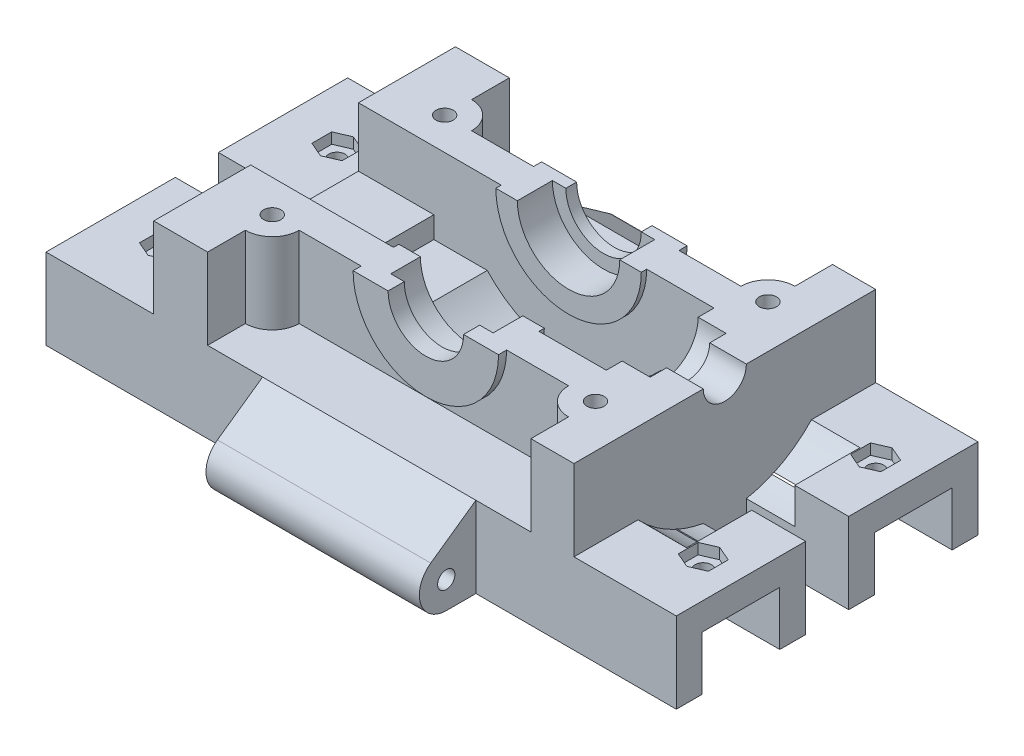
from build123d import *
from build123d.topology import SkipClean

# Parameters (mm, degrees)
SKETCH_1_W                = 10
SKETCH_1_H                = 35
EXTRUDE_3_DEPTH           = 6
SKETCH_1_5_W              = 19.8
SKETCH_1_5_H              = 10
EXTRUDE_4_DEPTH           = 16.5
SKETCH_2_R                = 1.6
CUT_EXTRUDE_1_DEPTH       = 39.6
SKETCH_1_6_W              = 19.8
SKETCH_1_6_H              = 10
SKETCH_1_6_W_2            = 10
SKETCH_1_6_H_2            = 35
EXTRUDE_5_DEPTH           = 40
SKETCH_3_W                = 39.6
SKETCH_3_H                = 10
EXTRUDE_6_DEPTH           = 10.5
SKETCH_4_R                = 1.6
CUT_EXTRUDE_2_DEPTH       = 39.6
EXTRUDE_7_DEPTH           = 12
EXTRUDE_8_REACH           = 114.364
SKETCH_6_W                = 7.093277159
SKETCH_6_H                = 12
SKETCH_6_W_2              = 11.017279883
EXTRUDE_9_DEPTH           = 20
EXTRUDE_9_DEPTH_BACK      = 5
SKETCH_10_W               = 8
SKETCH_10_H               = 7.758717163
CUT_EXTRUDE_10_DEPTH      = 10
SKETCH_9_R                = 1.5
CUT_EXTRUDE_11_DEPTH      = 130.929296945
SKETCH_19_W               = 60
SKETCH_19_H               = 56
EXTRUDE_13_DEPTH          = 5
SKETCH_18_W               = 14.4
SKETCH_18_H               = 10
CUT_EXTRUDE_9_DEPTH       = 142.736982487
EXTRUDE_14_DEPTH          = 20
EXTRUDE_14_DEPTH_BACK     = 100
SKETCH_18_5_W             = 4.8
SKETCH_18_5_H             = 10
SKETCH_11_W               = 2.5
SKETCH_11_H               = 56.730774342
EXTRUDE_15_DEPTH          = 10
SKETCH_20_R               = 1.5
CUT_EXTRUDE_12_DEPTH      = 5
SKETCH_20_3_R             = 1.5
CUT_EXTRUDE_13_DEPTH      = 2
SKETCH_22_W               = 14
SKETCH_22_H               = 15
SKETCH_22_H_2             = 20
CUT_EXTRUDE_14_DEPTH      = 10
CUT_EXTRUDE_15_DEPTH      = 10
CUT_EXTRUDE_15_DEPTH_BACK = 10
SKETCH_24_W               = 10
SKETCH_24_H               = 30
EXTRUDE_16_DEPTH          = 4
SKETCH_25_W               = 10
SKETCH_25_H               = 30
EXTRUDE_17_DEPTH          = 4
SKETCH_28_R               = 4
CUT_EXTRUDE_18_DEPTH      = 14
CUT_EXTRUDE_START         = -5.2
SKETCH_29_R               = 7.05
SKETCH_29_R_2             = 4
CUT_EXTRUDE_19_DEPTH      = 5.2
CUT_EXTRUDE_20_DEPTH      = 7
SKETCH_28_5_R             = 5.5
SKETCH_28_5_R_2           = 4
CUT_EXTRUDE_21_DEPTH      = 2
CUT_EXTRUDE_23_DEPTH      = 3
CUT_EXTRUDE_24_REACH      = 153.981
SKETCH_33_W               = 10
SKETCH_33_H               = 26
CUT_EXTRUDE_START_2       = -2
SKETCH_34_R               = 5.5
CUT_EXTRUDE_25_DEPTH      = 2
EXTRUDE_18_DEPTH          = 39.6
EXTRUDE_19_DEPTH          = 9
EXTRUDE_20_REACH          = 149.612
SKETCH_37_W               = 6
SKETCH_37_H               = 30
SKETCH_38_R               = 7
CUT_EXTRUDE_26_DEPTH      = 158.359422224
EXTRUDE_START             = 1.5
SKETCH_38_3_R             = 13.5
SKETCH_38_3_R_2           = 9.5
SKETCH_38_3_R_3           = 7
EXTRUDE_21_DEPTH          = 1.5
SKETCH_39_R               = 13.5
SKETCH_39_R_2             = 7
EXTRUDE_22_DEPTH          = 1.5
SKETCH_41_R               = 13.5
SKETCH_41_R_2             = 9.5
SKETCH_41_R_3             = 7
EXTRUDE_23_DEPTH          = 1
CUT_EXTRUDE_27_DEPTH      = 5.5
CUT_EXTRUDE_27_DEPTH_BACK = 4.5
SKETCH_41_3_R             = 9.5
SKETCH_41_3_R_2           = 7
EXTRUDE_START_2           = 1
SKETCH_42_R               = 13.5
SKETCH_42_R_2             = 9.5
SKETCH_42_R_3             = 7
EXTRUDE_24_DEPTH          = 1
CUT_EXTRUDE_28_DEPTH      = 1
CUT_EXTRUDE_28_DEPTH_BACK = 5.5
SKETCH_42_3_R             = 9.5
SKETCH_42_3_R_2           = 7
CUT_EXTRUDE_30_DEPTH      = 20
CUT_EXTRUDE_30_DEPTH_BACK = 136.224032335
SKETCH_43_R               = 1.6
EXTRUDE_25_DEPTH          = 15
SKETCH_45_R               = 1.6
CUT_EXTRUDE_31_DEPTH      = 3
SKETCH_46_R               = 1.6
CUT_EXTRUDE_32_DEPTH      = 3
EXTRUDE_START_3           = 30
EXTRUDE_26_DEPTH          = 30
SKETCH_48_W               = 198.317172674
SKETCH_48_H               = 160.47694892
CUT_EXTRUDE_33_DEPTH      = 148.85053757


with BuildPart() as part:
    # Sketch 1 → Extrude 3 (new body)
    with BuildSketch(Plane.XY):
        with Locations((-7.633778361, 10.555029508)):
            Rectangle(SKETCH_1_W, SKETCH_1_H)
        Polygon((-22.833778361, 38.055029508), (-22.833778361, 28.055029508), (-12.633778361, 28.055029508), (-2.633778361, 28.055029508), (-2.633778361, 38.055029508), align=None)
        Polygon((-12.633778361, -6.944970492), (-22.833778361, -6.944970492), (-22.833778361, -16.944970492), (-2.633778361, -16.944970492), (-2.633778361, -6.944970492), align=None)
        Polygon((-62.433778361, -6.944970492), (-72.633778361, -6.944970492), (-82.633778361, -6.944970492), (-82.633778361, -16.944970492), (-62.433778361, -16.944970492), align=None)
        with Locations((-77.633778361, 10.555029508)):
            Rectangle(SKETCH_1_W, SKETCH_1_H)
        Polygon((-82.633778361, 28.055029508), (-72.633778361, 28.055029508), (-62.433778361, 28.055029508), (-62.433778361, 38.055029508), (-82.633778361, 38.055029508), align=None)
    extrude(amount=EXTRUDE_3_DEPTH)

    # Sketch 1_5 → Extrude 4 (add)
    with BuildSketch(Plane.XY):
        with Locations((-52.533778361, 33.055029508)):
            Rectangle(SKETCH_1_5_W, SKETCH_1_5_H)
        with Locations((-32.733778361, 33.055029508)):
            Rectangle(SKETCH_1_5_W, SKETCH_1_5_H)
        with Locations((-52.533778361, -11.944970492)):
            Rectangle(SKETCH_1_5_W, SKETCH_1_5_H)
        with Locations((-32.733778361, -11.944970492)):
            Rectangle(SKETCH_1_5_W, SKETCH_1_5_H)
    extrude(amount=EXTRUDE_4_DEPTH)

    # Sketch 2 → Cut-Extrude 1 (cut)
    with BuildSketch(Plane(origin=(-22.833778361, 0, 0), x_dir=(0, 0, -1), z_dir=(1, 0, 0))):
        with Locations((-11.5, 33.055029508)):
            Circle(SKETCH_2_R)
        with BuildLine():
            Line((-16.5, 38.055029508), (-16.5, 33.055029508))
            ThreePointArc((-16.5, 33.055029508), (-15.035533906, 36.590563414), (-11.5, 38.055029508))
            Line((-11.5, 38.055029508), (-16.5, 38.055029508))
        make_face()
        with BuildLine():
            Line((-16.5, 33.055029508), (-16.5, 28.055029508))
            Line((-16.5, 28.055029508), (-11.5, 28.055029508))
            ThreePointArc((-11.5, 28.055029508), (-15.035533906, 29.519495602), (-16.5, 33.055029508))
        make_face()
        with Locations((-11.5, -11.944970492)):
            Circle(SKETCH_2_R)
        with BuildLine():
            Line((-16.5, -6.944970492), (-16.5, -11.944970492))
            ThreePointArc((-16.5, -11.944970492), (-15.035533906, -8.409436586), (-11.5, -6.944970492))
            Line((-11.5, -6.944970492), (-16.5, -6.944970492))
        make_face()
        with BuildLine():
            Line((-16.5, -11.944970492), (-16.5, -16.944970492))
            Line((-16.5, -16.944970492), (-11.5, -16.944970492))
            ThreePointArc((-11.5, -16.944970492), (-15.035533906, -15.480504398), (-16.5, -11.944970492))
        make_face()
    extrude(amount=-CUT_EXTRUDE_1_DEPTH, mode=Mode.SUBTRACT)

    # Sketch 1_6 → Extrude 5 (add)
    with BuildSketch(Plane.XY):
        Polygon((-22.833778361, 38.055029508), (-22.833778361, 28.055029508), (-12.633778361, 28.055029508), (-2.633778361, 28.055029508), (-2.633778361, 38.055029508), align=None)
        with Locations((-32.733778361, 33.055029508)):
            Rectangle(SKETCH_1_6_W, SKETCH_1_6_H)
        with Locations((-52.533778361, 33.055029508)):
            Rectangle(SKETCH_1_6_W, SKETCH_1_6_H)
        Polygon((-82.633778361, 28.055029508), (-72.633778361, 28.055029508), (-62.433778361, 28.055029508), (-62.433778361, 38.055029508), (-82.633778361, 38.055029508), align=None)
        with Locations((-77.633778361, 10.555029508)):
            Rectangle(SKETCH_1_6_W_2, SKETCH_1_6_H_2)
        Polygon((-62.433778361, -6.944970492), (-72.633778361, -6.944970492), (-82.633778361, -6.944970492), (-82.633778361, -16.944970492), (-62.433778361, -16.944970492), align=None)
        with Locations((-52.533778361, -11.944970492)):
            Rectangle(SKETCH_1_6_W, SKETCH_1_6_H)
        Polygon((-12.633778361, -6.944970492), (-22.833778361, -6.944970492), (-22.833778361, -16.944970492), (-2.633778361, -16.944970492), (-2.633778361, -6.944970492), align=None)
        with Locations((-7.633778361, 10.555029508)):
            Rectangle(SKETCH_1_6_W_2, SKETCH_1_6_H_2)
        with Locations((-32.733778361, -11.944970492)):
            Rectangle(SKETCH_1_6_W, SKETCH_1_6_H)
    extrude(amount=-EXTRUDE_5_DEPTH)

    # Sketch 3 → Extrude 6 (add)
    with BuildSketch(Plane(origin=(0, 0, -40), x_dir=(-1, 0, 0), z_dir=(0, 0, -1))):
        with Locations((42.633778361, 33.055029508)):
            Rectangle(SKETCH_3_W, SKETCH_3_H)
        with Locations((42.633778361, -11.944970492)):
            Rectangle(SKETCH_3_W, SKETCH_3_H)
    extrude(amount=EXTRUDE_6_DEPTH)

    # Sketch 4 → Cut-Extrude 2 (cut)
    with BuildSketch(Plane(origin=(-22.833778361, 0, 0), x_dir=(0, 0, -1), z_dir=(1, 0, 0))):
        with BuildLine():
            Line((50.5, 38.055029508), (45.5, 38.055029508))
            ThreePointArc((45.5, 38.055029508), (49.035533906, 36.590563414), (50.5, 33.055029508))
            Line((50.5, 33.055029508), (50.5, 38.055029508))
        make_face()
        with Locations((45.5, 33.055029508)):
            Circle(SKETCH_4_R)
        with BuildLine():
            ThreePointArc((50.5, 33.055029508), (49.035533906, 29.519495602), (45.5, 28.055029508))
            Line((45.5, 28.055029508), (50.5, 28.055029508))
            Line((50.5, 28.055029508), (50.5, 33.055029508))
        make_face()
        with BuildLine():
            ThreePointArc((50.5, -11.944970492), (49.035533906, -15.480504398), (45.5, -16.944970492))
            Line((45.5, -16.944970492), (50.5, -16.944970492))
            Line((50.5, -16.944970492), (50.5, -11.944970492))
        make_face()
        with BuildLine():
            Line((50.5, -6.944970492), (45.5, -6.944970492))
            ThreePointArc((45.5, -6.944970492), (49.035533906, -8.409436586), (50.5, -11.944970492))
            Line((50.5, -11.944970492), (50.5, -6.944970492))
        make_face()
        with Locations((45.5, -11.944970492)):
            Circle(SKETCH_4_R)
    extrude(amount=-CUT_EXTRUDE_2_DEPTH, mode=Mode.SUBTRACT)

    # Extrude 8: up to this face of the body (flat: up to its plane)
    extrude_8_end = Plane(part.part.faces().sort_by_distance((-42.633778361, 38.055029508, -17))[0])
    # Sketch 6 → Extrude 8 (add, up to the picked face)
    with BuildSketch(Plane(origin=(0, 45.962215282, -13.952833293), x_dir=(1, 0, 0), z_dir=(0, -0.9568804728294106, 0.290481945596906)), mode=Mode.PRIVATE) as extrude_8_sk1:
        with Locations((-79.087139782, -21.220919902)):
            Rectangle(SKETCH_6_W, SKETCH_6_H)
    extrude_8_tool1 = split(extrude(extrude_8_sk1.sketch, amount=EXTRUDE_8_REACH, mode=Mode.PRIVATE), bisect_by=extrude_8_end, keep=Keep.BOTH, mode=Mode.PRIVATE)
    # Sketch 6 → Extrude 8 (add, up to the picked face)
    with BuildSketch(Plane(origin=(0, 45.962215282, -13.952833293), x_dir=(1, 0, 0), z_dir=(0, -0.9568804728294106, 0.290481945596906)), mode=Mode.PRIVATE) as extrude_8_sk2:
        with Locations((-8.142418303, -21.220919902)):
            Rectangle(SKETCH_6_W_2, SKETCH_6_H)
    extrude_8_tool2 = split(extrude(extrude_8_sk2.sketch, amount=EXTRUDE_8_REACH, mode=Mode.PRIVATE), bisect_by=extrude_8_end, keep=Keep.BOTH, mode=Mode.PRIVATE)


with BuildPart() as body_2:
    # Sketch 5 → Extrude 7 (new body)
    with BuildSketch(Plane(origin=(0, -7.907185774, -26.047166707), x_dir=(1, 0, 0), z_dir=(0, 0.290481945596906, 0.9568804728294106))):
        Polygon((-73.133778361, 106.033392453), (-82.633778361, 48.033392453), (-77.567151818, 48.033392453), (-69.133778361, 99.521356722), (-69.133778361, 106.033392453), align=None)
        Polygon((-69.133778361, 106.033392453), (-69.133778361, 99.521356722), (-67.374533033, 97.888777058), (-13.651058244, 48.033392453), (-2.633778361, 48.033392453), (-65.133778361, 106.033392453), align=None)
        Polygon((-69.133778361, 99.521356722), (-77.567151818, 48.033392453), (-75.540501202, 48.033392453), (-69.133778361, 87.148121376), align=None)
        Polygon((-67.374533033, 97.888777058), (-69.133778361, 99.521356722), (-69.133778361, 87.148121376), align=None)
    extrude(amount=EXTRUDE_7_DEPTH)


with BuildPart() as part_1:
    add(part.part)

    add(body_2.part)  # Extrude 8 merges body 2
    add(extrude_8_tool1.solids().sort_by(Axis((-79.08714, 39.797921, -34.258717), (0, -0.9568804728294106, 0.290481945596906)))[0])
    add(extrude_8_tool2.solids().sort_by(Axis((-8.142418, 39.797921, -34.258717), (0, -0.9568804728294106, 0.290481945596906)))[0])

    # Sketch 7 → Extrude 9 (add, two sides: drawn at the far end of the back side and taken through both)
    with BuildSketch(Plane(origin=(0, 0, -45.365387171), x_dir=(-1, 0, 0), z_dir=(0, 0, -1)).offset(-EXTRUDE_9_DEPTH_BACK)):
        Polygon((73.133778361, 97.039880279), (65.133778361, 97.039880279), (59.133778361, 97.039880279), (59.133778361, 87.039880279), (79.133778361, 87.039880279), (79.133778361, 97.039880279), align=None)
    extrude(amount=EXTRUDE_9_DEPTH + EXTRUDE_9_DEPTH_BACK)

    # Sketch 10 → Cut-Extrude 10 (cut)
    with BuildSketch(Plane(origin=(0, 97.039880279, 0), x_dir=(1, 0, 0), z_dir=(0, 1, 0))):
        with Locations((-69.133778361, 61.48602859)):
            Rectangle(SKETCH_10_W, SKETCH_10_H)
    extrude(amount=-CUT_EXTRUDE_10_DEPTH, mode=Mode.SUBTRACT)

    # Sketch 9 → Cut-Extrude 11 (cut, through all)
    with BuildSketch(Plane(origin=(-59.133778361, 0, 0), x_dir=(0, 0, -1), z_dir=(1, 0, 0))):
        with BuildLine():
            Line((65.365387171, 97.039880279), (60.365387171, 97.039880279))
            ThreePointArc((60.365387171, 97.039880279), (63.900921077, 95.575414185), (65.365387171, 92.039880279))
            Line((65.365387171, 92.039880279), (65.365387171, 97.039880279))
        make_face()
        with BuildLine():
            Line((65.365387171, 87.039880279), (65.365387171, 92.039880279))
            ThreePointArc((65.365387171, 92.039880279), (63.900921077, 88.504346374), (60.365387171, 87.039880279))
            Line((60.365387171, 87.039880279), (65.365387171, 87.039880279))
        make_face()
        with Locations((60.365387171, 92.039880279)):
            Circle(SKETCH_9_R)
    extrude(amount=-CUT_EXTRUDE_11_DEPTH, mode=Mode.SUBTRACT)

    # Mirror 24: part across plane


with BuildPart() as part_2:
    add(part_1.part)
    add(part_1.part.mirror(Plane.XY.offset(-12)))

    # Sketch 19 → Extrude 13 (add)
    with BuildSketch(Plane(origin=(0, -6.944970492, 0), x_dir=(1, 0, 0), z_dir=(0, 1, 0))):
        with Locations((-42.633778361, 12)):
            Rectangle(SKETCH_19_W, SKETCH_19_H)
    extrude(amount=EXTRUDE_13_DEPTH)

    # Sketch 18 → Cut-Extrude 9 (cut, through all)
    with BuildSketch(Plane(origin=(-2.633778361, 0, 0), x_dir=(0, 0, -1), z_dir=(1, 0, 0))):
        with Locations((-4, -11.944970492)):
            Rectangle(SKETCH_18_W, SKETCH_18_H)
        with Locations((28, -11.944970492)):
            Rectangle(SKETCH_18_W, SKETCH_18_H)
    extrude(amount=-CUT_EXTRUDE_9_DEPTH, mode=Mode.SUBTRACT)

    # Sketch 18_5 → Extrude 14 (add, two sides: drawn at the far end of the back side and taken through both)
    with BuildSketch(Plane(origin=(-2.633778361, 0, 0), x_dir=(0, 0, -1), z_dir=(1, 0, 0)).offset(-EXTRUDE_14_DEPTH_BACK)):
        Polygon((-16, -1.944970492), (-16, -6.944970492), (-11.2, -6.944970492), (3.2, -6.944970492), (8, -6.944970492), (8, -1.944970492), align=None)
        with Locations((-13.6, -11.944970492)):
            Rectangle(SKETCH_18_5_W, SKETCH_18_5_H)
        with Locations((5.6, -11.944970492)):
            Rectangle(SKETCH_18_5_W, SKETCH_18_5_H)
        Polygon((40, -1.944970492), (16, -1.944970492), (16, -6.944970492), (20.8, -6.944970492), (35.2, -6.944970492), (40, -6.944970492), align=None)
        with Locations((18.4, -11.944970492)):
            Rectangle(SKETCH_18_5_W, SKETCH_18_5_H)
        with Locations((37.6, -11.944970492)):
            Rectangle(SKETCH_18_5_W, SKETCH_18_5_H)
    extrude(amount=EXTRUDE_14_DEPTH + EXTRUDE_14_DEPTH_BACK)

    # Sketch 11 → Extrude 15 (add)
    with BuildSketch(Plane(origin=(0, 97.039880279, 0), x_dir=(1, 0, 0), z_dir=(0, 1, 0))):
        with Locations((-67.883778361, 12)):
            Rectangle(SKETCH_11_W, SKETCH_11_H)
        with Locations((-70.383778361, 12)):
            Rectangle(SKETCH_11_W, SKETCH_11_H)
    extrude(amount=-EXTRUDE_15_DEPTH)

    # Sketch 20 → Cut-Extrude 12 (cut)
    with BuildSketch(Plane(origin=(0, -1.944970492, 0), x_dir=(1, 0, 0), z_dir=(0, 1, 0))):
        with Locations(Location((7.366221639, -4, 0), (0, 0, 270))):
            Circle(SKETCH_20_R)
        with Locations(Location((7.366221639, 28, 0), (0, 0, 270))):
            Circle(SKETCH_20_R)
        with Locations(Location((-92.633778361, 28, 0), (0, 0, 270))):
            Circle(SKETCH_20_R)
        with Locations(Location((-92.633778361, -4, 0), (0, 0, 270))):
            Circle(SKETCH_20_R)
    extrude(amount=-CUT_EXTRUDE_12_DEPTH, mode=Mode.SUBTRACT)

    # Sketch 20_3 → Cut-Extrude 13 (cut)
    # profile 1 of 4: a face of its own
    with BuildSketch(Plane(origin=(0, -1.944970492, 0), x_dir=(1, 0, 0), z_dir=(0, 1, 0))):
        Polygon((4.566221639, -2.159338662), (7.366221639, -0.95), (10.166221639, -2.159338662), (10.166221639, -5.840661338), (7.366221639, -7.05), (4.566221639, -5.840661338), align=None)
        with Locations(Location((7.366221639, -4, 0), (0, 0, 270))):
            Circle(SKETCH_20_3_R, mode=Mode.SUBTRACT)
    # profile 2 of 4: a face of its own
    with BuildSketch(Plane(origin=(0, -1.944970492, 0), x_dir=(1, 0, 0), z_dir=(0, 1, 0))):
        Polygon((4.566221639, 29.840661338), (7.366221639, 31.05), (10.166221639, 29.840661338), (10.166221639, 26.159338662), (7.366221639, 24.95), (4.566221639, 26.159338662), align=None)
        with Locations(Location((7.366221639, 28, 0), (0, 0, 270))):
            Circle(SKETCH_20_3_R, mode=Mode.SUBTRACT)
    # profile 3 of 4: a face of its own
    with BuildSketch(Plane(origin=(0, -1.944970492, 0), x_dir=(1, 0, 0), z_dir=(0, 1, 0))):
        Polygon((-95.433778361, 29.840661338), (-92.633778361, 31.05), (-89.833778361, 29.840661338), (-89.833778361, 26.159338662), (-92.633778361, 24.95), (-95.433778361, 26.159338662), align=None)
        with Locations(Location((-92.633778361, 28, 0), (0, 0, 270))):
            Circle(SKETCH_20_3_R, mode=Mode.SUBTRACT)
    # profile 4 of 4: a face of its own
    with BuildSketch(Plane(origin=(0, -1.944970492, 0), x_dir=(1, 0, 0), z_dir=(0, 1, 0))):
        Polygon((-95.433778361, -2.159338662), (-92.633778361, -0.95), (-89.833778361, -2.159338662), (-89.833778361, -5.840661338), (-92.633778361, -7.05), (-95.433778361, -5.840661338), align=None)
        with Locations(Location((-92.633778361, -4, 0), (0, 0, 270))):
            Circle(SKETCH_20_3_R, mode=Mode.SUBTRACT)
    extrude(amount=-CUT_EXTRUDE_13_DEPTH, mode=Mode.SUBTRACT)

    # Sketch 22 → Cut-Extrude 14 (cut)
    with BuildSketch(Plane(origin=(0, 38.055029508, 0), x_dir=(1, 0, 0), z_dir=(0, 1, 0))):
        with Locations((-42.633778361, 29.5)):
            Rectangle(SKETCH_22_W, SKETCH_22_H)
        with Locations((-42.633778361, 12)):
            Rectangle(SKETCH_22_W, SKETCH_22_H_2)
        with Locations((-56.633778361, 12)):
            Rectangle(SKETCH_22_W, SKETCH_22_H_2)
        with Locations((-42.633778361, -5.5)):
            Rectangle(SKETCH_22_W, SKETCH_22_H)
        with Locations((-28.633778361, 12)):
            Rectangle(SKETCH_22_W, SKETCH_22_H_2)
    extrude(amount=-CUT_EXTRUDE_14_DEPTH, mode=Mode.SUBTRACT)

    # Sketch 23 → Cut-Extrude 15 (cut, two sides: drawn at the far end of the back side and taken through both)
    with BuildSketch(Plane.XY.offset(-12).offset(-CUT_EXTRUDE_15_DEPTH_BACK)):
        with BuildLine():
            Line((-51.798929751, -6.944970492), (-33.468626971, -6.944970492))
            ThreePointArc((-33.468626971, -6.944970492), (-29.759401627, -4.784545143), (-26.540301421, -1.944970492))
            Line((-26.540301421, -1.944970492), (-58.7272553, -1.944970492))
            ThreePointArc((-58.7272553, -1.944970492), (-55.508155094, -4.784545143), (-51.798929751, -6.944970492))
        make_face()
        with BuildLine():
            ThreePointArc((-51.798929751, -6.944970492), (-42.633778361, -8.944970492), (-33.468626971, -6.944970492))
            Line((-33.468626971, -6.944970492), (-51.798929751, -6.944970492))
        make_face()
    extrude(amount=CUT_EXTRUDE_15_DEPTH + CUT_EXTRUDE_15_DEPTH_BACK, mode=Mode.SUBTRACT)

    # Sketch 24 → Extrude 16 (add)
    with BuildSketch(Plane(origin=(-72.633778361, 0, 0), x_dir=(0, 0, -1), z_dir=(1, 0, 0))):
        with Locations((7, 13.055029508)):
            Rectangle(SKETCH_24_W, SKETCH_24_H)
        with Locations((17, 13.055029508)):
            Rectangle(SKETCH_24_W, SKETCH_24_H)
    extrude(amount=EXTRUDE_16_DEPTH)

    # Sketch 25 → Extrude 17 (add)
    with BuildSketch(Plane.ZY.offset(12.633778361)):
        with Locations((-17, 13.055029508)):
            Rectangle(SKETCH_25_W, SKETCH_25_H)
        with Locations((-7, 13.055029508)):
            Rectangle(SKETCH_25_W, SKETCH_25_H)
    extrude(amount=EXTRUDE_17_DEPTH)

    # Sketch 28 → Cut-Extrude 18 (cut)
    with BuildSketch(Plane(origin=(-2.633778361, 0, 0), x_dir=(0, 0, -1), z_dir=(1, 0, 0))):
        with Locations((12, 13.055029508)):
            Circle(SKETCH_28_R)
    extrude(amount=-CUT_EXTRUDE_18_DEPTH, mode=Mode.SUBTRACT)

    # Sketch 29 → Cut-Extrude 19 (cut)
    with BuildSketch(Plane.ZY.offset(16.633778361).offset(CUT_EXTRUDE_START)):
        with Locations(Location((-12, 13.055029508, 0), (0, 0, 270))):
            Circle(SKETCH_29_R)
        with Locations(Location((-12, 13.055029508, 0), (0, 0, 180))):
            Circle(SKETCH_29_R_2, mode=Mode.SUBTRACT)
    extrude(amount=CUT_EXTRUDE_19_DEPTH, mode=Mode.SUBTRACT)

    # Sketch 28_4 → Cut-Extrude 20 (cut)
    with BuildSketch(Plane(origin=(-2.633778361, 0, 0), x_dir=(0, 0, -1), z_dir=(1, 0, 0))):
        with BuildLine():
            Line((8, -1.944970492), (2, -1.944970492))
            Line((2, -1.944970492), (-4.093476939, -1.944970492))
            ThreePointArc((-4.093476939, -1.944970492), (1.419964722, -6.233901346), (8, -8.578278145))
            Line((8, -8.578278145), (8, -1.944970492))
        make_face()
        with BuildLine():
            Line((22, -1.944970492), (16, -1.944970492))
            Line((16, -1.944970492), (16, -8.578278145))
            ThreePointArc((16, -8.578278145), (22.580035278, -6.233901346), (28.093476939, -1.944970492))
            Line((28.093476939, -1.944970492), (22, -1.944970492))
        make_face()
    extrude(amount=CUT_EXTRUDE_20_DEPTH, mode=Mode.SUBTRACT)

    # Sketch 28_5 → Cut-Extrude 21 (cut)
    with BuildSketch(Plane(origin=(-2.633778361, 0, 0), x_dir=(0, 0, -1), z_dir=(1, 0, 0))):
        with Locations((12, 13.055029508)):
            Circle(SKETCH_28_5_R)
        with Locations((12, 13.055029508)):
            Circle(SKETCH_28_5_R_2, mode=Mode.SUBTRACT)
    extrude(amount=-CUT_EXTRUDE_21_DEPTH, mode=Mode.SUBTRACT)

    # Sketch 32 → Cut-Extrude 23 (cut)
    with BuildSketch(Plane(origin=(17.366221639, 0, 0), x_dir=(0, 0, -1), z_dir=(1, 0, 0))):
        Polygon((8, -16.944970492), (8, -1.944970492), (-16, -1.944970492), (-16, -16.944970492), (-11.2, -16.944970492), (-11.2, -6.944970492), (3.2, -6.944970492), (3.2, -16.944970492), align=None)
        Polygon((40, -1.944970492), (16, -1.944970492), (16, -16.944970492), (20.8, -16.944970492), (20.8, -6.944970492), (35.2, -6.944970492), (35.2, -16.944970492), (40, -16.944970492), align=None)
    extrude(amount=-CUT_EXTRUDE_23_DEPTH, mode=Mode.SUBTRACT)

    # Cut-Extrude 24: up to this face of the body (flat: up to its plane)
    cut_extrude_24_end = Plane(part_2.part.faces().sort_by_distance((-68.633778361, 13.055029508, -12))[0])
    # Sketch 33 → Cut-Extrude 24 (cut, up to the picked face)
    with BuildSketch(Plane.ZY.offset(82.633778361), mode=Mode.PRIVATE) as cut_extrude_24_sk1:
        with Locations((-17, 15.055029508)):
            Rectangle(SKETCH_33_W, SKETCH_33_H)
    cut_extrude_24_tool1 = split(extrude(cut_extrude_24_sk1.sketch, amount=-CUT_EXTRUDE_24_REACH, mode=Mode.PRIVATE), bisect_by=cut_extrude_24_end, keep=Keep.BOTH, mode=Mode.PRIVATE)
    # Sketch 33 → Cut-Extrude 24 (cut, up to the picked face)
    with BuildSketch(Plane.ZY.offset(82.633778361), mode=Mode.PRIVATE) as cut_extrude_24_sk2:
        with Locations((-7, 15.055029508)):
            Rectangle(SKETCH_33_W, SKETCH_33_H)
    cut_extrude_24_tool2 = split(extrude(cut_extrude_24_sk2.sketch, amount=-CUT_EXTRUDE_24_REACH, mode=Mode.PRIVATE), bisect_by=cut_extrude_24_end, keep=Keep.BOTH, mode=Mode.PRIVATE)
    add(cut_extrude_24_tool1.solids().sort_by(Axis((-82.633778, 15.05503, -17), (1, 0, 0)))[0], mode=Mode.SUBTRACT)
    add(cut_extrude_24_tool2.solids().sort_by(Axis((-82.633778, 15.05503, -7), (1, 0, 0)))[0], mode=Mode.SUBTRACT)

    # Sketch 34 → Cut-Extrude 25 (cut)
    # profile 1 of 3: a face of its own
    with BuildSketch(Plane(origin=(-2.633778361, 0, 0), x_dir=(0, 0, -1), z_dir=(1, 0, 0)).offset(CUT_EXTRUDE_START_2)):
        with BuildLine():
            Line((20.8, -6.944970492), (21.16515139, -6.944970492))
            ThreePointArc((21.16515139, -6.944970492), (24.874376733, -4.784545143), (28.093476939, -1.944970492))
            Line((28.093476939, -1.944970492), (40, -1.944970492))
            Line((40, -1.944970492), (40, 38.055029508))
            Line((40, 38.055029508), (28.517434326, 41.540812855))
            Line((28.517434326, 41.540812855), (27.459248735, 38.055029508))
            Line((27.459248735, 38.055029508), (-3.459248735, 38.055029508))
            Line((-3.459248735, 38.055029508), (-4.517434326, 41.540812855))
            Line((-4.517434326, 41.540812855), (-16, 38.055029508))
            Line((-16, 38.055029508), (-16, -1.944970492))
            Line((-16, -1.944970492), (-4.093476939, -1.944970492))
            ThreePointArc((-4.093476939, -1.944970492), (-0.874376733, -4.784545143), (2.83484861, -6.944970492))
            Line((2.83484861, -6.944970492), (3.2, -6.944970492))
            Line((3.2, -6.944970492), (3.2, -7.10830355))
            ThreePointArc((3.2, -7.10830355), (5.557934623, -7.980649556), (8, -8.578278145))
            Line((8, -8.578278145), (8, -16.944970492))
            Line((8, -16.944970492), (16, -16.944970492))
            Line((16, -16.944970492), (16, -8.578278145))
            ThreePointArc((16, -8.578278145), (18.442065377, -7.980649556), (20.8, -7.10830355))
            Line((20.8, -7.10830355), (20.8, -6.944970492))
        make_face()
        with Locations((12, 13.055029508)):
            Circle(SKETCH_34_R, mode=Mode.SUBTRACT)
    # profile 2 of 3: a face of its own
    with BuildSketch(Plane(origin=(-2.633778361, 0, 0), x_dir=(0, 0, -1), z_dir=(1, 0, 0)).offset(CUT_EXTRUDE_START_2)):
        Polygon((-4.517434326, 41.540812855), (-19.747983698, 91.711969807), (-31.230549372, 88.22618646), (-16, 38.055029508), align=None)
    # profile 3 of 3: a face of its own
    with BuildSketch(Plane(origin=(-2.633778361, 0, 0), x_dir=(0, 0, -1), z_dir=(1, 0, 0)).offset(CUT_EXTRUDE_START_2)):
        Polygon((40, 38.055029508), (55.230549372, 88.22618646), (43.747983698, 91.711969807), (28.517434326, 41.540812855), align=None)
    extrude(amount=CUT_EXTRUDE_25_DEPTH, mode=Mode.SUBTRACT)

    # Sketch 35 → Extrude 18 (add)
    with BuildSketch(Plane(origin=(-22.833778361, 0, 0), x_dir=(0, 0, -1), z_dir=(1, 0, 0))):
        with BuildLine():
            Line((-16, -6.944970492), (-16, -1.944970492))
            Line((-16, -1.944970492), (-24.382588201, -7.859546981))
            ThreePointArc((-24.382588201, -7.859546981), (-23.012098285, -7.179096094), (-21.5, -6.944970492))
            Line((-21.5, -6.944970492), (-16, -6.944970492))
        make_face()
        with BuildLine():
            Line((48.382588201, -7.859546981), (40, -1.944970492))
            Line((40, -1.944970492), (40, -6.944970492))
            Line((40, -6.944970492), (45.5, -6.944970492))
            ThreePointArc((45.5, -6.944970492), (47.012098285, -7.179096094), (48.382588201, -7.859546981))
        make_face()
    extrude(amount=-EXTRUDE_18_DEPTH)

    # Sketch 36 → Extrude 19 (add)
    with BuildSketch(Plane(origin=(0, 38.055029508, 0), x_dir=(1, 0, 0), z_dir=(0, 1, 0))):
        Polygon((-22.833778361, -16), (-13.651058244, -3.459248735), (-13.651058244, -16), align=None)
        Polygon((-13.651058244, 27.459248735), (-22.833778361, 40), (-13.651058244, 40), align=None)
    extrude(amount=EXTRUDE_19_DEPTH)

    # Extrude 20: up to this face of the body (flat: up to its plane)
    extrude_20_end = Plane(part_2.part.faces().sort_by_distance((-72.633778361, 13.055029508, -31))[0])
    # Sketch 37 → Extrude 20 (add, up to the picked face)
    with BuildSketch(Plane.ZY.offset(12.633778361), mode=Mode.PRIVATE) as extrude_20_sk1:
        with Locations((-25, 13.055029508)):
            Rectangle(SKETCH_37_W, SKETCH_37_H)
    extrude_20_tool1 = split(extrude(extrude_20_sk1.sketch, amount=EXTRUDE_20_REACH, mode=Mode.PRIVATE), bisect_by=extrude_20_end, keep=Keep.BOTH, mode=Mode.PRIVATE)
    # Sketch 37 → Extrude 20 (add, up to the picked face)
    with BuildSketch(Plane.ZY.offset(12.633778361), mode=Mode.PRIVATE) as extrude_20_sk2:
        with Locations((1, 13.055029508)):
            Rectangle(SKETCH_37_W, SKETCH_37_H)
    extrude_20_tool2 = split(extrude(extrude_20_sk2.sketch, amount=EXTRUDE_20_REACH, mode=Mode.PRIVATE), bisect_by=extrude_20_end, keep=Keep.BOTH, mode=Mode.PRIVATE)
    add(extrude_20_tool1.solids().sort_by(Axis((-12.633778, 13.05503, -25), (-1, 0, 0)))[0])
    add(extrude_20_tool2.solids().sort_by(Axis((-12.633778, 13.05503, 1), (-1, 0, 0)))[0])

    # Sketch 38 → Cut-Extrude 26 (cut, through all)
    with BuildSketch(Plane.XY.offset(4)):
        with Locations((-42.633778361, 13.055029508)):
            Circle(SKETCH_38_R)
    extrude(amount=-CUT_EXTRUDE_26_DEPTH, mode=Mode.SUBTRACT)

    # Sketch 38_3 → Extrude 21 (add)
    # profile 1 of 2: a face of its own
    with BuildSketch(Plane.XY.offset(4).offset(EXTRUDE_START)):
        with Locations((-42.633778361, 13.055029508)):
            Circle(SKETCH_38_3_R)
        with Locations((-42.633778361, 13.055029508)):
            Circle(SKETCH_38_3_R_2, mode=Mode.SUBTRACT)
    # profile 2 of 2: a face of its own
    with BuildSketch(Plane.XY.offset(4).offset(EXTRUDE_START)):
        with Locations((-42.633778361, 13.055029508)):
            Circle(SKETCH_38_3_R_2)
        with Locations((-42.633778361, 13.055029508)):
            Circle(SKETCH_38_3_R_3, mode=Mode.SUBTRACT)
    extrude(amount=-EXTRUDE_21_DEPTH)

    # Sketch 39 → Extrude 22 (add)
    with BuildSketch(Plane(origin=(0, 0, -28), x_dir=(-1, 0, 0), z_dir=(0, 0, -1))):
        with Locations(Location((42.633778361, 13.055029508, 0), (0, 0, 180))):
            Circle(SKETCH_39_R)
        with Locations(Location((42.633778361, 13.055029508, 0), (0, 0, 180))):
            Circle(SKETCH_39_R_2, mode=Mode.SUBTRACT)
    extrude(amount=EXTRUDE_22_DEPTH)

    # Sketch 41 → Extrude 23 (add)
    # profile 1 of 2: a face of its own
    with BuildSketch(Plane(origin=(0, 0, -2), x_dir=(-1, 0, 0), z_dir=(0, 0, -1))):
        with Locations(Location((42.633778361, 13.055029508, 0), (0, 0, 180))):
            Circle(SKETCH_41_R)
        with Locations((42.633778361, 13.055029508)):
            Circle(SKETCH_41_R_2, mode=Mode.SUBTRACT)
    # profile 2 of 2: a face of its own
    with BuildSketch(Plane(origin=(0, 0, -2), x_dir=(-1, 0, 0), z_dir=(0, 0, -1))):
        with Locations((42.633778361, 13.055029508)):
            Circle(SKETCH_41_R_2)
        with Locations(Location((42.633778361, 13.055029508, 0), (0, 0, 180))):
            Circle(SKETCH_41_R_3, mode=Mode.SUBTRACT)
    extrude(amount=EXTRUDE_23_DEPTH)

    # Sketch 41_3 → Cut-Extrude 27 (cut, two sides: drawn at the far end of the back side and taken through both)
    with BuildSketch(Plane(origin=(0, 0, -2), x_dir=(-1, 0, 0), z_dir=(0, 0, -1)).offset(-CUT_EXTRUDE_27_DEPTH_BACK)):
        with Locations(Location((42.633778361, 13.055029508, 0), (0, 0, 90))):
            Circle(SKETCH_41_3_R)
        with Locations(Location((42.633778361, 13.055029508, 0), (0, 0, 180))):
            Circle(SKETCH_41_3_R_2, mode=Mode.SUBTRACT)
    extrude(amount=CUT_EXTRUDE_27_DEPTH + CUT_EXTRUDE_27_DEPTH_BACK, mode=Mode.SUBTRACT)

    # Sketch 42 → Extrude 24 (add)
    # profile 1 of 2: a face of its own
    with BuildSketch(Plane.XY.offset(-22).offset(EXTRUDE_START_2)):
        with Locations((-42.633778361, 13.055029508)):
            Circle(SKETCH_42_R)
        with Locations(Location((-42.633778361, 13.055029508, 0), (0, 0, 90))):
            Circle(SKETCH_42_R_2, mode=Mode.SUBTRACT)
    # profile 2 of 2: a face of its own
    with BuildSketch(Plane.XY.offset(-22).offset(EXTRUDE_START_2)):
        with Locations(Location((-42.633778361, 13.055029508, 0), (0, 0, 90))):
            Circle(SKETCH_42_R_2)
        with Locations((-42.633778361, 13.055029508)):
            Circle(SKETCH_42_R_3, mode=Mode.SUBTRACT)
    extrude(amount=-EXTRUDE_24_DEPTH)

    # Sketch 42_3 → Cut-Extrude 28 (cut, two sides: drawn at the far end of the back side and taken through both)
    with BuildSketch(Plane.XY.offset(-22).offset(-CUT_EXTRUDE_28_DEPTH_BACK)):
        with Locations(Location((-42.633778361, 13.055029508, 0), (0, 0, 90))):
            Circle(SKETCH_42_3_R)
        with Locations((-42.633778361, 13.055029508)):
            Circle(SKETCH_42_3_R_2, mode=Mode.SUBTRACT)
    extrude(amount=CUT_EXTRUDE_28_DEPTH + CUT_EXTRUDE_28_DEPTH_BACK, mode=Mode.SUBTRACT)

    # Sketch 43 → Cut-Extrude 30 (cut, two sides: drawn at the far end of the back side and taken through both)
    with BuildSketch(Plane(origin=(0, 38.055029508, 0), x_dir=(1, 0, 0), z_dir=(0, 1, 0)).offset(-CUT_EXTRUDE_30_DEPTH_BACK)):
        with Locations(Location((-72.633778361, -4, 0), (0, 0, 90))):
            Circle(SKETCH_43_R)
        with Locations(Location((-72.633778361, 28, 0), (0, 0, 90))):
            Circle(SKETCH_43_R)
        with Locations(Location((-12.633778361, 28, 0), (0, 0, 90))):
            Circle(SKETCH_43_R)
        with Locations(Location((-12.633778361, -4, 0), (0, 0, 90))):
            Circle(SKETCH_43_R)
    extrude(amount=CUT_EXTRUDE_30_DEPTH + CUT_EXTRUDE_30_DEPTH_BACK, mode=Mode.SUBTRACT)

    # Sketch 44 → Extrude 25 (add)
    with BuildSketch(Plane(origin=(0, 38.055029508, 0), x_dir=(1, 0, 0), z_dir=(0, 1, 0))):
        with BuildLine():
            Line((-8.633778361, 32), (-16.633778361, 32))
            Line((-16.633778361, 32), (-13.765149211, 29.13137085))
            ThreePointArc((-13.765149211, 29.13137085), (-12.633778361, 29.6), (-11.502407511, 29.13137085))
            Line((-11.502407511, 29.13137085), (-8.633778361, 32))
        make_face()
        with BuildLine():
            Line((-8.633778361, 27.459248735), (-8.633778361, 32))
            Line((-8.633778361, 32), (-11.502407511, 29.13137085))
            ThreePointArc((-11.502407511, 29.13137085), (-11.155571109, 28.612293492), (-11.033778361, 28))
            ThreePointArc((-11.033778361, 28), (-11.057491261, 27.725556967), (-11.127927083, 27.459248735))
            Line((-11.127927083, 27.459248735), (-8.633778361, 27.459248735))
        make_face()
        with BuildLine():
            Line((-8.633778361, 24), (-8.633778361, 27.459248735))
            Line((-8.633778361, 27.459248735), (-11.127927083, 27.459248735))
            ThreePointArc((-11.127927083, 27.459248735), (-11.282503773, 27.143228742), (-11.502407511, 26.86862915))
            Line((-11.502407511, 26.86862915), (-8.633778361, 24))
        make_face()
        with BuildLine():
            Line((-13.765149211, 26.86862915), (-16.633778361, 24))
            Line((-16.633778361, 24), (-8.633778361, 24))
            Line((-8.633778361, 24), (-11.502407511, 26.86862915))
            ThreePointArc((-11.502407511, 26.86862915), (-12.633778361, 26.4), (-13.765149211, 26.86862915))
        make_face()
        with BuildLine():
            Line((-14.216872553, 28.231975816), (-16.633778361, 31.532720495))
            Line((-16.633778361, 31.532720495), (-16.633778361, 24))
            Line((-16.633778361, 24), (-13.765149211, 26.86862915))
            ThreePointArc((-13.765149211, 26.86862915), (-14.152580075, 27.496769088), (-14.216872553, 28.231975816))
        make_face()
        with BuildLine():
            Line((-13.765149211, 29.13137085), (-16.633778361, 32))
            Line((-16.633778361, 32), (-16.633778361, 31.532720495))
            Line((-16.633778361, 31.532720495), (-14.216872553, 28.231975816))
            ThreePointArc((-14.216872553, 28.231975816), (-14.063571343, 28.718117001), (-13.765149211, 29.13137085))
        make_face()
        with BuildLine():
            Line((-16.633778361, -7.532720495), (-16.633778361, -8))
            Line((-16.633778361, -8), (-13.765149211, -5.13137085))
            ThreePointArc((-13.765149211, -5.13137085), (-14.063571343, -4.718117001), (-14.216872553, -4.231975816))
            Line((-14.216872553, -4.231975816), (-16.633778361, -7.532720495))
        make_face()
        with BuildLine():
            Line((-16.633778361, -8), (-8.633778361, -8))
            Line((-8.633778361, -8), (-11.502407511, -5.13137085))
            ThreePointArc((-11.502407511, -5.13137085), (-12.633778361, -5.6), (-13.765149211, -5.13137085))
            Line((-13.765149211, -5.13137085), (-16.633778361, -8))
        make_face()
        with BuildLine():
            Line((-8.633778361, -8), (-8.633778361, -3.459248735))
            Line((-8.633778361, -3.459248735), (-11.127927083, -3.459248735))
            ThreePointArc((-11.127927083, -3.459248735), (-11.057491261, -3.725556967), (-11.033778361, -4))
            ThreePointArc((-11.033778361, -4), (-11.155571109, -4.612293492), (-11.502407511, -5.13137085))
            Line((-11.502407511, -5.13137085), (-8.633778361, -8))
        make_face()
        with BuildLine():
            Line((-11.127927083, -3.459248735), (-8.633778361, -3.459248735))
            Line((-8.633778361, -3.459248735), (-8.633778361, 0))
            Line((-8.633778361, 0), (-11.502407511, -2.86862915))
            ThreePointArc((-11.502407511, -2.86862915), (-11.282503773, -3.143228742), (-11.127927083, -3.459248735))
        make_face()
        with BuildLine():
            Line((-11.502407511, -2.86862915), (-8.633778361, 0))
            Line((-8.633778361, 0), (-16.633778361, 0))
            Line((-16.633778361, 0), (-13.765149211, -2.86862915))
            ThreePointArc((-13.765149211, -2.86862915), (-12.633778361, -2.4), (-11.502407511, -2.86862915))
        make_face()
        with BuildLine():
            Line((-13.765149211, -2.86862915), (-16.633778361, 0))
            Line((-16.633778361, 0), (-16.633778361, -7.532720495))
            Line((-16.633778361, -7.532720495), (-14.216872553, -4.231975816))
            ThreePointArc((-14.216872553, -4.231975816), (-14.152580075, -3.496769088), (-13.765149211, -2.86862915))
        make_face()
    extrude(amount=EXTRUDE_25_DEPTH)

    # Sketch 45 → Cut-Extrude 31 (cut)
    # profile 1 of 2: a face of its own
    with BuildSketch(Plane(origin=(0, 53.055029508, 0), x_dir=(1, 0, 0), z_dir=(0, 1, 0))):
        Polygon((-15.433778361, -2.159338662), (-12.633778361, -0.95), (-9.833778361, -2.159338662), (-9.833778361, -5.840661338), (-12.633778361, -7.05), (-15.433778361, -5.840661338), align=None)
        with Locations(Location((-12.633778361, -4, 0), (0, 0, 90))):
            Circle(SKETCH_45_R, mode=Mode.SUBTRACT)
    # profile 2 of 2: a face of its own
    with BuildSketch(Plane(origin=(0, 53.055029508, 0), x_dir=(1, 0, 0), z_dir=(0, 1, 0))):
        Polygon((-15.433778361, 29.840661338), (-12.633778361, 31.05), (-9.833778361, 29.840661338), (-9.833778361, 26.159338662), (-12.633778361, 24.95), (-15.433778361, 26.159338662), align=None)
        with Locations(Location((-12.633778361, 28, 0), (0, 0, 90))):
            Circle(SKETCH_45_R, mode=Mode.SUBTRACT)
    extrude(amount=-CUT_EXTRUDE_31_DEPTH, mode=Mode.SUBTRACT)

    # Sketch 46 → Cut-Extrude 32 (cut)
    # profile 1 of 2: a face of its own
    with BuildSketch(Plane(origin=(0, 38.055029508, 0), x_dir=(1, 0, 0), z_dir=(0, 1, 0))):
        Polygon((-75.433778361, -2.159338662), (-72.633778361, -0.95), (-69.833778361, -2.159338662), (-69.833778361, -5.840661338), (-72.633778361, -7.05), (-75.433778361, -5.840661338), align=None)
        with Locations(Location((-72.633778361, -4, 0), (0, 0, 90))):
            Circle(SKETCH_46_R, mode=Mode.SUBTRACT)
    # profile 2 of 2: a face of its own
    with BuildSketch(Plane(origin=(0, 38.055029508, 0), x_dir=(1, 0, 0), z_dir=(0, 1, 0))):
        Polygon((-75.433778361, 29.840661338), (-72.633778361, 31.05), (-69.833778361, 29.840661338), (-69.833778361, 26.159338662), (-72.633778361, 24.95), (-75.433778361, 26.159338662), align=None)
        with Locations(Location((-72.633778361, 28, 0), (0, 0, 90))):
            Circle(SKETCH_46_R, mode=Mode.SUBTRACT)
    extrude(amount=-CUT_EXTRUDE_32_DEPTH, mode=Mode.SUBTRACT)

    # Sketch 47 → Extrude 26 (add)
    with SkipClean():  # the faces are left unmerged after this step: merging them gives an invalid solid
        with BuildSketch(Plane(origin=(0, -1.944970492, 0), x_dir=(1, 0, 0), z_dir=(0, 1, 0)).offset(EXTRUDE_START_3)):
            with BuildLine():
                ThreePointArc((-17.633778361, -4), (-16.169312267, -7.535533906), (-12.633778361, -9))
                Line((-12.633778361, -9), (-12.633778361, -5.6))
                ThreePointArc((-12.633778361, -5.6), (-13.765149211, -5.13137085), (-14.233778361, -4))
                Line((-14.233778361, -4), (-17.633778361, -4))
            make_face()
            with BuildLine():
                ThreePointArc((-72.633778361, -9), (-69.098244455, -7.535533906), (-67.633778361, -4))
                Line((-67.633778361, -4), (-71.033778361, -4))
                ThreePointArc((-71.033778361, -4), (-71.502407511, -5.13137085), (-72.633778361, -5.6))
                Line((-72.633778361, -5.6), (-72.633778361, -9))
            make_face()
            with BuildLine():
                ThreePointArc((-72.633778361, 29.6), (-71.502407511, 29.13137085), (-71.033778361, 28))
                Line((-71.033778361, 28), (-67.633778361, 28))
                ThreePointArc((-67.633778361, 28), (-69.098244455, 31.535533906), (-72.633778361, 33))
                Line((-72.633778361, 33), (-72.633778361, 29.6))
            make_face()
            with BuildLine():
                ThreePointArc((-12.633778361, 33), (-16.169312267, 31.535533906), (-17.633778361, 28))
                Line((-17.633778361, 28), (-14.233778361, 28))
                ThreePointArc((-14.233778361, 28), (-13.765149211, 29.13137085), (-12.633778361, 29.6))
                Line((-12.633778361, 29.6), (-12.633778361, 33))
            make_face()
        extrude(amount=-EXTRUDE_26_DEPTH)

    # Sketch 48 → Cut-Extrude 33 (cut, through all)
    with BuildSketch(Plane(origin=(0, 13.055029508, 0), x_dir=(1, 0, 0), z_dir=(0, 1, 0))):
        with Locations((-43.359773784, 9.849987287)):
            Rectangle(SKETCH_48_W, SKETCH_48_H)
    extrude(amount=CUT_EXTRUDE_33_DEPTH, mode=Mode.SUBTRACT)


solid = part_2.part
